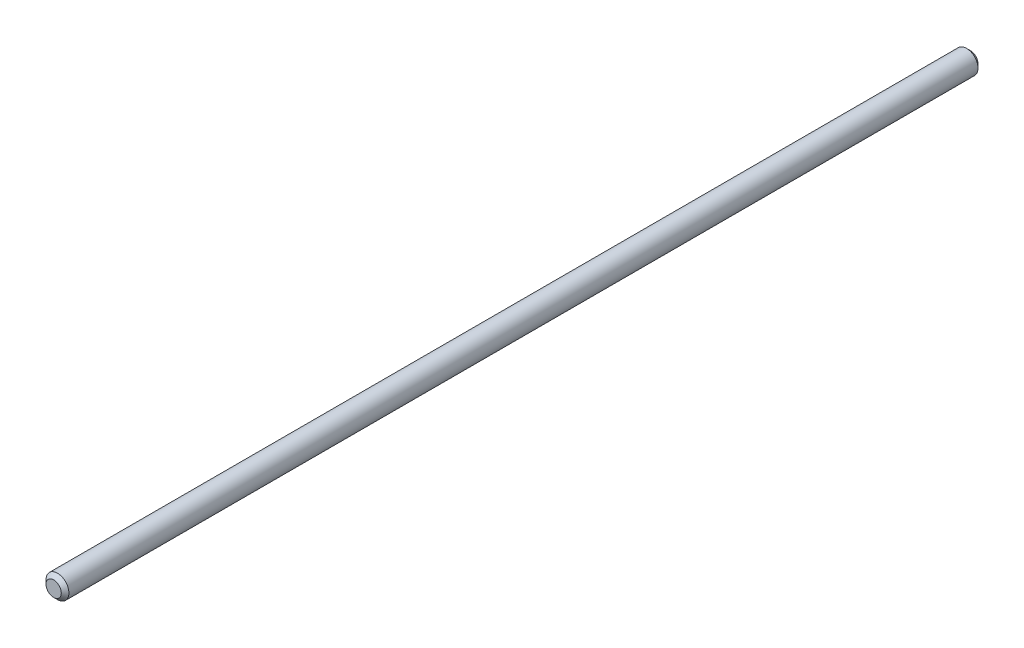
from build123d import *

# Parameters (mm, degrees)
ESQUISSE1_R          = 1.5
BASE_EXTRUSION_DEPTH = 120
CHANFREIN1_SIZE      = 0.5


with BuildPart() as part:
    # Esquisse1 → Base-Extrusion (new body)
    with BuildSketch(Plane.XY):
        Circle(ESQUISSE1_R)
    extrude(amount=BASE_EXTRUSION_DEPTH)

    # Chanfrein1
    chanfrein1_edges = [part.edges().sort_by_distance(p)[0] for p in [
        (-1.5, 0, 0),
        (-1.5, 0, 120),
    ]]
    chamfer(chanfrein1_edges, length=CHANFREIN1_SIZE)


solid = part.part
